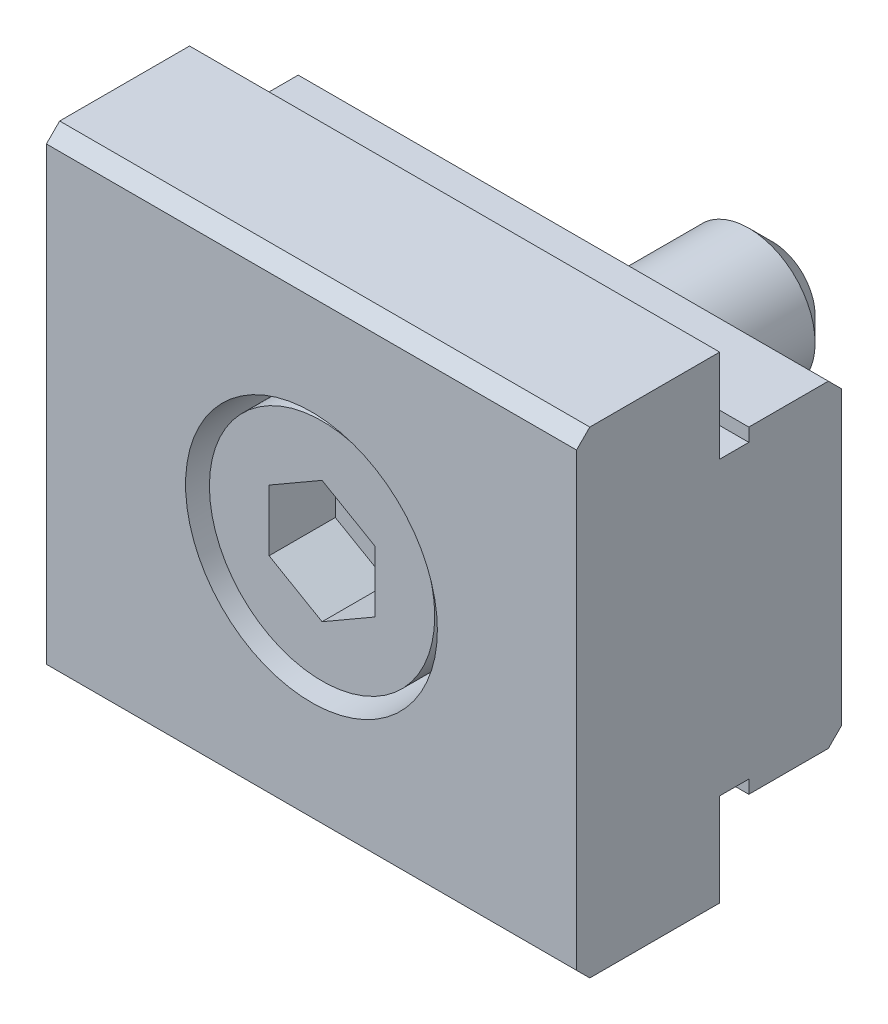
ISO-10303-21;
HEADER;
FILE_DESCRIPTION(('STEP AP214'),'2;1');
FILE_NAME('part.step','',(''),(''),'','','');
FILE_SCHEMA(('AUTOMOTIVE_DESIGN { 1 0 10303 214 1 1 1 1 }'));
ENDSEC;
DATA;
#1=APPLICATION_CONTEXT('core data for automotive mechanical design processes');
#2=APPLICATION_PROTOCOL_DEFINITION('international standard','automotive_design',2000,#1);
#3=PRODUCT_CONTEXT('',#1,'mechanical');
#4=PRODUCT('Part','Part','',(#3));
#5=PRODUCT_RELATED_PRODUCT_CATEGORY('part','',(#4));
#6=PRODUCT_DEFINITION_FORMATION('','',#4);
#7=PRODUCT_DEFINITION_CONTEXT('part definition',#1,'design');
#8=PRODUCT_DEFINITION('design','',#6,#7);
#9=PRODUCT_DEFINITION_SHAPE('','',#8);
#10=(LENGTH_UNIT() NAMED_UNIT(*) SI_UNIT(.MILLI.,.METRE.));
#11=(NAMED_UNIT(*) PLANE_ANGLE_UNIT() SI_UNIT($,.RADIAN.));
#12=(NAMED_UNIT(*) SI_UNIT($,.STERADIAN.) SOLID_ANGLE_UNIT());
#13=UNCERTAINTY_MEASURE_WITH_UNIT(LENGTH_MEASURE(1.E-05),#10,'distance_accuracy_value','');
#14=(GEOMETRIC_REPRESENTATION_CONTEXT(3) GLOBAL_UNCERTAINTY_ASSIGNED_CONTEXT((#13)) GLOBAL_UNIT_ASSIGNED_CONTEXT((#10,
#11,#12)) REPRESENTATION_CONTEXT('',''));
#15=CARTESIAN_POINT('',(0.,0.,0.));
#16=DIRECTION('',(0.,0.,1.));
#17=DIRECTION('',(1.,0.,0.));
#18=AXIS2_PLACEMENT_3D('',#15,#16,#17);
#19=CARTESIAN_POINT('',(-12.5,-6.,-1.1));
#20=DIRECTION('',(0.,0.,-1.));
#21=DIRECTION('',(-1.,0.,0.));
#22=AXIS2_PLACEMENT_3D('',#19,#20,#21);
#23=PLANE('',#22);
#24=DIRECTION('',(0.,1.,0.));
#25=VECTOR('',#24,1.);
#26=CARTESIAN_POINT('',(-10.,-6.,-1.1));
#27=LINE('',#26,#25);
#28=CARTESIAN_POINT('',(-10.,-6.,-1.1));
#29=VERTEX_POINT('',#28);
#30=CARTESIAN_POINT('',(-10.,-5.5,-1.1));
#31=VERTEX_POINT('',#30);
#32=EDGE_CURVE('E359',#29,#31,#27,.T.);
#33=ORIENTED_EDGE('',*,*,#32,.F.);
#34=DIRECTION('',(1.,0.,0.));
#35=VECTOR('',#34,1.);
#36=CARTESIAN_POINT('',(-12.5,-6.,-1.1));
#37=LINE('',#36,#35);
#38=CARTESIAN_POINT('',(10.,-6.,-1.1));
#39=VERTEX_POINT('',#38);
#40=EDGE_CURVE('E218',#29,#39,#37,.T.);
#41=ORIENTED_EDGE('',*,*,#40,.T.);
#42=DIRECTION('',(0.,-1.,0.));
#43=VECTOR('',#42,1.);
#44=CARTESIAN_POINT('',(10.,-6.,-1.1));
#45=LINE('',#44,#43);
#46=CARTESIAN_POINT('',(10.,-5.5,-1.1));
#47=VERTEX_POINT('',#46);
#48=EDGE_CURVE('E341',#47,#39,#45,.T.);
#49=ORIENTED_EDGE('',*,*,#48,.F.);
#50=DIRECTION('',(1.,0.,0.));
#51=VECTOR('',#50,1.);
#52=CARTESIAN_POINT('',(-12.5,-5.5,-1.1));
#53=LINE('',#52,#51);
#54=EDGE_CURVE('E215',#31,#47,#53,.T.);
#55=ORIENTED_EDGE('',*,*,#54,.F.);
#56=EDGE_LOOP('',(#33,#41,#49,#55));
#57=FACE_BOUND('',#56,.T.);
#58=ADVANCED_FACE('F14',(#57),#23,.F.);
#59=CARTESIAN_POINT('',(-12.5,-6.,-4.1));
#60=DIRECTION('',(0.,1.,0.));
#61=DIRECTION('',(1.,0.,0.));
#62=AXIS2_PLACEMENT_3D('',#59,#60,#61);
#63=PLANE('',#62);
#64=DIRECTION('',(0.,0.,1.));
#65=VECTOR('',#64,1.);
#66=CARTESIAN_POINT('',(-10.,-6.,-4.1));
#67=LINE('',#66,#65);
#68=CARTESIAN_POINT('',(-10.,-6.,-4.1));
#69=VERTEX_POINT('',#68);
#70=EDGE_CURVE('E357',#69,#29,#67,.T.);
#71=ORIENTED_EDGE('',*,*,#70,.F.);
#72=DIRECTION('',(1.,0.,0.));
#73=VECTOR('',#72,1.);
#74=CARTESIAN_POINT('',(-12.5,-6.,-4.1));
#75=LINE('',#74,#73);
#76=CARTESIAN_POINT('',(10.,-6.,-4.1));
#77=VERTEX_POINT('',#76);
#78=EDGE_CURVE('E221',#69,#77,#75,.T.);
#79=ORIENTED_EDGE('',*,*,#78,.T.);
#80=DIRECTION('',(0.,0.,-1.));
#81=VECTOR('',#80,1.);
#82=CARTESIAN_POINT('',(10.,-6.,-4.1));
#83=LINE('',#82,#81);
#84=EDGE_CURVE('E339',#39,#77,#83,.T.);
#85=ORIENTED_EDGE('',*,*,#84,.F.);
#86=ORIENTED_EDGE('',*,*,#40,.F.);
#87=EDGE_LOOP('',(#71,#79,#85,#86));
#88=FACE_BOUND('',#87,.T.);
#89=ADVANCED_FACE('F400',(#88),#63,.F.);
#90=CARTESIAN_POINT('',(-12.5,6.,-4.1));
#91=DIRECTION('',(0.,-1.,0.));
#92=DIRECTION('',(-1.,0.,0.));
#93=AXIS2_PLACEMENT_3D('',#90,#91,#92);
#94=PLANE('',#93);
#95=DIRECTION('',(0.,0.,-1.));
#96=VECTOR('',#95,1.);
#97=CARTESIAN_POINT('',(-10.,6.,-4.1));
#98=LINE('',#97,#96);
#99=CARTESIAN_POINT('',(-10.,6.,-1.1));
#100=VERTEX_POINT('',#99);
#101=CARTESIAN_POINT('',(-10.,6.,-4.1));
#102=VERTEX_POINT('',#101);
#103=EDGE_CURVE('E24',#100,#102,#98,.T.);
#104=ORIENTED_EDGE('',*,*,#103,.F.);
#105=DIRECTION('',(1.,0.,0.));
#106=VECTOR('',#105,1.);
#107=CARTESIAN_POINT('',(-12.5,6.,-1.1));
#108=LINE('',#107,#106);
#109=CARTESIAN_POINT('',(10.,6.,-1.1));
#110=VERTEX_POINT('',#109);
#111=EDGE_CURVE('E188',#100,#110,#108,.T.);
#112=ORIENTED_EDGE('',*,*,#111,.T.);
#113=DIRECTION('',(0.,0.,1.));
#114=VECTOR('',#113,1.);
#115=CARTESIAN_POINT('',(10.,6.,-4.1));
#116=LINE('',#115,#114);
#117=CARTESIAN_POINT('',(10.,6.,-4.1));
#118=VERTEX_POINT('',#117);
#119=EDGE_CURVE('E191',#118,#110,#116,.T.);
#120=ORIENTED_EDGE('',*,*,#119,.F.);
#121=DIRECTION('',(1.,0.,0.));
#122=VECTOR('',#121,1.);
#123=CARTESIAN_POINT('',(-12.5,6.,-4.1));
#124=LINE('',#123,#122);
#125=EDGE_CURVE('E190',#102,#118,#124,.T.);
#126=ORIENTED_EDGE('',*,*,#125,.F.);
#127=EDGE_LOOP('',(#104,#112,#120,#126));
#128=FACE_BOUND('',#127,.T.);
#129=ADVANCED_FACE('F186',(#128),#94,.F.);
#130=CARTESIAN_POINT('',(-12.5,6.,-1.1));
#131=DIRECTION('',(0.,0.,-1.));
#132=DIRECTION('',(-1.,0.,0.));
#133=AXIS2_PLACEMENT_3D('',#130,#131,#132);
#134=PLANE('',#133);
#135=DIRECTION('',(0.,1.,0.));
#136=VECTOR('',#135,1.);
#137=CARTESIAN_POINT('',(-10.,6.,-1.1));
#138=LINE('',#137,#136);
#139=CARTESIAN_POINT('',(-10.,5.5,-1.1));
#140=VERTEX_POINT('',#139);
#141=EDGE_CURVE('E171',#140,#100,#138,.T.);
#142=ORIENTED_EDGE('',*,*,#141,.F.);
#143=DIRECTION('',(1.,0.,0.));
#144=VECTOR('',#143,1.);
#145=CARTESIAN_POINT('',(-12.5,5.5,-1.1));
#146=LINE('',#145,#144);
#147=CARTESIAN_POINT('',(10.,5.5,-1.1));
#148=VERTEX_POINT('',#147);
#149=EDGE_CURVE('E196',#140,#148,#146,.T.);
#150=ORIENTED_EDGE('',*,*,#149,.T.);
#151=DIRECTION('',(0.,-1.,0.));
#152=VECTOR('',#151,1.);
#153=CARTESIAN_POINT('',(10.,6.,-1.1));
#154=LINE('',#153,#152);
#155=EDGE_CURVE('E195',#110,#148,#154,.T.);
#156=ORIENTED_EDGE('',*,*,#155,.F.);
#157=ORIENTED_EDGE('',*,*,#111,.F.);
#158=EDGE_LOOP('',(#142,#150,#156,#157));
#159=FACE_BOUND('',#158,.T.);
#160=ADVANCED_FACE('F194',(#159),#134,.F.);
#161=CARTESIAN_POINT('',(-12.5,5.5,-1.1));
#162=DIRECTION('',(0.,-1.,0.));
#163=DIRECTION('',(-1.,0.,0.));
#164=AXIS2_PLACEMENT_3D('',#161,#162,#163);
#165=PLANE('',#164);
#166=DIRECTION('',(0.,0.,-1.));
#167=VECTOR('',#166,1.);
#168=CARTESIAN_POINT('',(-10.,5.5,-1.1));
#169=LINE('',#168,#167);
#170=CARTESIAN_POINT('',(-10.,5.5,0.));
#171=VERTEX_POINT('',#170);
#172=EDGE_CURVE('E176',#171,#140,#169,.T.);
#173=ORIENTED_EDGE('',*,*,#172,.F.);
#174=DIRECTION('',(-1.,0.,0.));
#175=VECTOR('',#174,1.);
#176=CARTESIAN_POINT('',(10.,5.5,0.));
#177=LINE('',#176,#175);
#178=CARTESIAN_POINT('',(10.,5.5,0.));
#179=VERTEX_POINT('',#178);
#180=EDGE_CURVE('E310',#179,#171,#177,.T.);
#181=ORIENTED_EDGE('',*,*,#180,.F.);
#182=DIRECTION('',(0.,0.,1.));
#183=VECTOR('',#182,1.);
#184=CARTESIAN_POINT('',(10.,5.5,-1.1));
#185=LINE('',#184,#183);
#186=EDGE_CURVE('E331',#148,#179,#185,.T.);
#187=ORIENTED_EDGE('',*,*,#186,.F.);
#188=ORIENTED_EDGE('',*,*,#149,.F.);
#189=EDGE_LOOP('',(#173,#181,#187,#188));
#190=FACE_BOUND('',#189,.T.);
#191=ADVANCED_FACE('F671',(#190),#165,.F.);
#192=CARTESIAN_POINT('',(-10.,5.5,0.));
#193=DIRECTION('',(0.,0.,-1.));
#194=DIRECTION('',(-1.,0.,0.));
#195=AXIS2_PLACEMENT_3D('',#192,#193,#194);
#196=PLANE('',#195);
#197=ORIENTED_EDGE('',*,*,#180,.T.);
#198=DIRECTION('',(0.,1.,0.));
#199=VECTOR('',#198,1.);
#200=CARTESIAN_POINT('',(-10.,5.5,0.));
#201=LINE('',#200,#199);
#202=CARTESIAN_POINT('',(-10.,9.,0.));
#203=VERTEX_POINT('',#202);
#204=EDGE_CURVE('E313',#171,#203,#201,.T.);
#205=ORIENTED_EDGE('',*,*,#204,.T.);
#206=DIRECTION('',(1.,0.,0.));
#207=VECTOR('',#206,1.);
#208=CARTESIAN_POINT('',(-10.,9.,0.));
#209=LINE('',#208,#207);
#210=CARTESIAN_POINT('',(10.,9.,0.));
#211=VERTEX_POINT('',#210);
#212=EDGE_CURVE('E315',#203,#211,#209,.T.);
#213=ORIENTED_EDGE('',*,*,#212,.T.);
#214=DIRECTION('',(0.,-1.,0.));
#215=VECTOR('',#214,1.);
#216=CARTESIAN_POINT('',(10.,9.,0.));
#217=LINE('',#216,#215);
#218=EDGE_CURVE('E317',#211,#179,#217,.T.);
#219=ORIENTED_EDGE('',*,*,#218,.T.);
#220=EDGE_LOOP('',(#197,#205,#213,#219));
#221=FACE_BOUND('',#220,.T.);
#222=ADVANCED_FACE('F661',(#221),#196,.T.);
#223=CARTESIAN_POINT('',(-12.5,9.,-0.1));
#224=DIRECTION('',(0.,-1.,0.));
#225=DIRECTION('',(-1.,0.,0.));
#226=AXIS2_PLACEMENT_3D('',#223,#224,#225);
#227=PLANE('',#226);
#228=ORIENTED_EDGE('',*,*,#212,.F.);
#229=DIRECTION('',(0.,0.,1.));
#230=VECTOR('',#229,1.);
#231=CARTESIAN_POINT('',(-10.,9.,-14.6));
#232=LINE('',#231,#230);
#233=CARTESIAN_POINT('',(-10.,9.,4.9));
#234=VERTEX_POINT('',#233);
#235=EDGE_CURVE('E320',#203,#234,#232,.T.);
#236=ORIENTED_EDGE('',*,*,#235,.T.);
#237=DIRECTION('',(1.,0.,0.));
#238=VECTOR('',#237,1.);
#239=CARTESIAN_POINT('',(-12.5,9.,4.9));
#240=LINE('',#239,#238);
#241=CARTESIAN_POINT('',(10.,9.,4.9));
#242=VERTEX_POINT('',#241);
#243=EDGE_CURVE('E198',#234,#242,#240,.T.);
#244=ORIENTED_EDGE('',*,*,#243,.T.);
#245=DIRECTION('',(0.,0.,-1.));
#246=VECTOR('',#245,1.);
#247=CARTESIAN_POINT('',(10.,9.,-14.6));
#248=LINE('',#247,#246);
#249=EDGE_CURVE('E322',#242,#211,#248,.T.);
#250=ORIENTED_EDGE('',*,*,#249,.T.);
#251=EDGE_LOOP('',(#228,#236,#244,#250));
#252=FACE_BOUND('',#251,.T.);
#253=ADVANCED_FACE('F651',(#252),#227,.F.);
#254=CARTESIAN_POINT('',(-12.5,9.,4.9));
#255=DIRECTION('',(0.,-0.707106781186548,-0.707106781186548));
#256=DIRECTION('',(0.,-0.707106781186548,0.707106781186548));
#257=AXIS2_PLACEMENT_3D('',#254,#255,#256);
#258=PLANE('',#257);
#259=DIRECTION('',(0.,0.707106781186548,-0.707106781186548));
#260=VECTOR('',#259,1.);
#261=CARTESIAN_POINT('',(-10.,9.,4.9));
#262=LINE('',#261,#260);
#263=CARTESIAN_POINT('',(-10.,8.5,5.4));
#264=VERTEX_POINT('',#263);
#265=EDGE_CURVE('E362',#264,#234,#262,.T.);
#266=ORIENTED_EDGE('',*,*,#265,.F.);
#267=DIRECTION('',(1.,0.,0.));
#268=VECTOR('',#267,1.);
#269=CARTESIAN_POINT('',(-12.5,8.5,5.4));
#270=LINE('',#269,#268);
#271=CARTESIAN_POINT('',(10.,8.5,5.4));
#272=VERTEX_POINT('',#271);
#273=EDGE_CURVE('E206',#264,#272,#270,.T.);
#274=ORIENTED_EDGE('',*,*,#273,.T.);
#275=DIRECTION('',(0.,-0.707106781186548,0.707106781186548));
#276=VECTOR('',#275,1.);
#277=CARTESIAN_POINT('',(10.,9.,4.9));
#278=LINE('',#277,#276);
#279=EDGE_CURVE('E345',#242,#272,#278,.T.);
#280=ORIENTED_EDGE('',*,*,#279,.F.);
#281=ORIENTED_EDGE('',*,*,#243,.F.);
#282=EDGE_LOOP('',(#266,#274,#280,#281));
#283=FACE_BOUND('',#282,.T.);
#284=ADVANCED_FACE('F641',(#283),#258,.F.);
#285=CARTESIAN_POINT('',(-12.5,8.5,5.4));
#286=DIRECTION('',(0.,0.,-1.));
#287=DIRECTION('',(-1.,0.,0.));
#288=AXIS2_PLACEMENT_3D('',#285,#286,#287);
#289=PLANE('',#288);
#290=CARTESIAN_POINT('',(0.,0.,5.4));
#291=DIRECTION('',(0.,0.,1.));
#292=DIRECTION('',(1.,0.,0.));
#293=AXIS2_PLACEMENT_3D('',#290,#291,#292);
#294=CIRCLE('',#293,4.75);
#295=CARTESIAN_POINT('',(4.75,0.,5.4));
#296=VERTEX_POINT('',#295);
#297=EDGE_CURVE('E299',#296,#296,#294,.T.);
#298=ORIENTED_EDGE('',*,*,#297,.F.);
#299=EDGE_LOOP('',(#298));
#300=FACE_BOUND('',#299,.T.);
#301=DIRECTION('',(0.,1.,0.));
#302=VECTOR('',#301,1.);
#303=CARTESIAN_POINT('',(-10.,8.5,5.4));
#304=LINE('',#303,#302);
#305=CARTESIAN_POINT('',(-10.,-8.5,5.4));
#306=VERTEX_POINT('',#305);
#307=EDGE_CURVE('E365',#306,#264,#304,.T.);
#308=ORIENTED_EDGE('',*,*,#307,.F.);
#309=DIRECTION('',(1.,0.,0.));
#310=VECTOR('',#309,1.);
#311=CARTESIAN_POINT('',(-12.5,-8.5,5.4));
#312=LINE('',#311,#310);
#313=CARTESIAN_POINT('',(10.,-8.5,5.4));
#314=VERTEX_POINT('',#313);
#315=EDGE_CURVE('E209',#306,#314,#312,.T.);
#316=ORIENTED_EDGE('',*,*,#315,.T.);
#317=DIRECTION('',(0.,-1.,0.));
#318=VECTOR('',#317,1.);
#319=CARTESIAN_POINT('',(10.,8.5,5.4));
#320=LINE('',#319,#318);
#321=EDGE_CURVE('E347',#272,#314,#320,.T.);
#322=ORIENTED_EDGE('',*,*,#321,.F.);
#323=ORIENTED_EDGE('',*,*,#273,.F.);
#324=EDGE_LOOP('',(#308,#316,#322,#323));
#325=FACE_BOUND('',#324,.T.);
#326=ADVANCED_FACE('F375',(#300,#325),#289,.F.);
#327=CARTESIAN_POINT('',(0.,0.,5.4));
#328=DIRECTION('',(0.,0.,1.));
#329=DIRECTION('',(1.,0.,0.));
#330=AXIS2_PLACEMENT_3D('',#327,#328,#329);
#331=CYLINDRICAL_SURFACE('',#330,4.75);
#332=CARTESIAN_POINT('',(0.,0.,0.));
#333=DIRECTION('',(0.,0.,1.));
#334=DIRECTION('',(1.,0.,0.));
#335=AXIS2_PLACEMENT_3D('',#332,#333,#334);
#336=CIRCLE('',#335,4.75);
#337=CARTESIAN_POINT('',(4.75,0.,0.));
#338=VERTEX_POINT('',#337);
#339=EDGE_CURVE('E294',#338,#338,#336,.T.);
#340=ORIENTED_EDGE('',*,*,#339,.F.);
#341=EDGE_LOOP('',(#340));
#342=FACE_BOUND('',#341,.T.);
#343=ORIENTED_EDGE('',*,*,#297,.T.);
#344=EDGE_LOOP('',(#343));
#345=FACE_BOUND('',#344,.T.);
#346=ADVANCED_FACE('F622',(#342,#345),#331,.F.);
#347=CARTESIAN_POINT('',(-2.75,0.,0.));
#348=DIRECTION('',(0.,0.,-1.));
#349=DIRECTION('',(-1.,0.,0.));
#350=AXIS2_PLACEMENT_3D('',#347,#348,#349);
#351=PLANE('',#350);
#352=CARTESIAN_POINT('',(0.,0.,0.));
#353=DIRECTION('',(0.,0.,-1.));
#354=DIRECTION('',(-1.,0.,0.));
#355=AXIS2_PLACEMENT_3D('',#352,#353,#354);
#356=CIRCLE('',#355,4.25);
#357=CARTESIAN_POINT('',(-4.25,0.,0.));
#358=VERTEX_POINT('',#357);
#359=EDGE_CURVE('E9',#358,#358,#356,.T.);
#360=ORIENTED_EDGE('',*,*,#359,.T.);
#361=EDGE_LOOP('',(#360));
#362=FACE_BOUND('',#361,.T.);
#363=ORIENTED_EDGE('',*,*,#339,.T.);
#364=EDGE_LOOP('',(#363));
#365=FACE_BOUND('',#364,.T.);
#366=ADVANCED_FACE('F396',(#362,#365),#351,.F.);
#367=CARTESIAN_POINT('',(-12.5,-9.,4.9));
#368=DIRECTION('',(0.,0.707106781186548,-0.707106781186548));
#369=DIRECTION('',(0.,-0.707106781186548,-0.707106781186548));
#370=AXIS2_PLACEMENT_3D('',#367,#368,#369);
#371=PLANE('',#370);
#372=DIRECTION('',(0.,0.707106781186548,0.707106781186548));
#373=VECTOR('',#372,1.);
#374=CARTESIAN_POINT('',(-10.,-9.,4.9));
#375=LINE('',#374,#373);
#376=CARTESIAN_POINT('',(-10.,-9.,4.9));
#377=VERTEX_POINT('',#376);
#378=EDGE_CURVE('E200',#377,#306,#375,.T.);
#379=ORIENTED_EDGE('',*,*,#378,.F.);
#380=DIRECTION('',(1.,0.,0.));
#381=VECTOR('',#380,1.);
#382=CARTESIAN_POINT('',(-12.5,-9.,4.9));
#383=LINE('',#382,#381);
#384=CARTESIAN_POINT('',(10.,-9.,4.9));
#385=VERTEX_POINT('',#384);
#386=EDGE_CURVE('E212',#377,#385,#383,.T.);
#387=ORIENTED_EDGE('',*,*,#386,.T.);
#388=DIRECTION('',(0.,-0.707106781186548,-0.707106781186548));
#389=VECTOR('',#388,1.);
#390=CARTESIAN_POINT('',(10.,-9.,4.9));
#391=LINE('',#390,#389);
#392=EDGE_CURVE('E181',#314,#385,#391,.T.);
#393=ORIENTED_EDGE('',*,*,#392,.F.);
#394=ORIENTED_EDGE('',*,*,#315,.F.);
#395=EDGE_LOOP('',(#379,#387,#393,#394));
#396=FACE_BOUND('',#395,.T.);
#397=ADVANCED_FACE('F378',(#396),#371,.F.);
#398=CARTESIAN_POINT('',(-12.5,-9.,-0.1));
#399=DIRECTION('',(0.,1.,0.));
#400=DIRECTION('',(1.,0.,0.));
#401=AXIS2_PLACEMENT_3D('',#398,#399,#400);
#402=PLANE('',#401);
#403=DIRECTION('',(-1.,0.,0.));
#404=VECTOR('',#403,1.);
#405=CARTESIAN_POINT('',(10.,-9.,0.));
#406=LINE('',#405,#404);
#407=CARTESIAN_POINT('',(10.,-9.,0.));
#408=VERTEX_POINT('',#407);
#409=CARTESIAN_POINT('',(-10.,-9.,0.));
#410=VERTEX_POINT('',#409);
#411=EDGE_CURVE('E33',#408,#410,#406,.T.);
#412=ORIENTED_EDGE('',*,*,#411,.F.);
#413=DIRECTION('',(0.,0.,-1.));
#414=VECTOR('',#413,1.);
#415=CARTESIAN_POINT('',(10.,-9.,-14.6));
#416=LINE('',#415,#414);
#417=EDGE_CURVE('E327',#385,#408,#416,.T.);
#418=ORIENTED_EDGE('',*,*,#417,.F.);
#419=ORIENTED_EDGE('',*,*,#386,.F.);
#420=DIRECTION('',(0.,0.,1.));
#421=VECTOR('',#420,1.);
#422=CARTESIAN_POINT('',(-10.,-9.,-14.6));
#423=LINE('',#422,#421);
#424=EDGE_CURVE('E325',#410,#377,#423,.T.);
#425=ORIENTED_EDGE('',*,*,#424,.F.);
#426=EDGE_LOOP('',(#412,#418,#419,#425));
#427=FACE_BOUND('',#426,.T.);
#428=ADVANCED_FACE('F384',(#427),#402,.F.);
#429=CARTESIAN_POINT('',(-10.,-9.,0.));
#430=DIRECTION('',(0.,0.,-1.));
#431=DIRECTION('',(-1.,0.,0.));
#432=AXIS2_PLACEMENT_3D('',#429,#430,#431);
#433=PLANE('',#432);
#434=ORIENTED_EDGE('',*,*,#411,.T.);
#435=DIRECTION('',(0.,1.,0.));
#436=VECTOR('',#435,1.);
#437=CARTESIAN_POINT('',(-10.,-9.,0.));
#438=LINE('',#437,#436);
#439=CARTESIAN_POINT('',(-10.,-5.5,0.));
#440=VERTEX_POINT('',#439);
#441=EDGE_CURVE('E303',#410,#440,#438,.T.);
#442=ORIENTED_EDGE('',*,*,#441,.T.);
#443=DIRECTION('',(1.,0.,0.));
#444=VECTOR('',#443,1.);
#445=CARTESIAN_POINT('',(-10.,-5.5,0.));
#446=LINE('',#445,#444);
#447=CARTESIAN_POINT('',(10.,-5.5,0.));
#448=VERTEX_POINT('',#447);
#449=EDGE_CURVE('E305',#440,#448,#446,.T.);
#450=ORIENTED_EDGE('',*,*,#449,.T.);
#451=DIRECTION('',(0.,-1.,0.));
#452=VECTOR('',#451,1.);
#453=CARTESIAN_POINT('',(10.,-5.5,0.));
#454=LINE('',#453,#452);
#455=EDGE_CURVE('E308',#448,#408,#454,.T.);
#456=ORIENTED_EDGE('',*,*,#455,.T.);
#457=EDGE_LOOP('',(#434,#442,#450,#456));
#458=FACE_BOUND('',#457,.T.);
#459=ADVANCED_FACE('F386',(#458),#433,.T.);
#460=CARTESIAN_POINT('',(-12.5,-5.5,-1.1));
#461=DIRECTION('',(0.,1.,0.));
#462=DIRECTION('',(1.,0.,0.));
#463=AXIS2_PLACEMENT_3D('',#460,#461,#462);
#464=PLANE('',#463);
#465=DIRECTION('',(0.,0.,1.));
#466=VECTOR('',#465,1.);
#467=CARTESIAN_POINT('',(-10.,-5.5,-1.1));
#468=LINE('',#467,#466);
#469=EDGE_CURVE('E86',#31,#440,#468,.T.);
#470=ORIENTED_EDGE('',*,*,#469,.F.);
#471=ORIENTED_EDGE('',*,*,#54,.T.);
#472=DIRECTION('',(0.,0.,-1.));
#473=VECTOR('',#472,1.);
#474=CARTESIAN_POINT('',(10.,-5.5,-1.1));
#475=LINE('',#474,#473);
#476=EDGE_CURVE('E343',#448,#47,#475,.T.);
#477=ORIENTED_EDGE('',*,*,#476,.F.);
#478=ORIENTED_EDGE('',*,*,#449,.F.);
#479=EDGE_LOOP('',(#470,#471,#477,#478));
#480=FACE_BOUND('',#479,.T.);
#481=ADVANCED_FACE('F394',(#480),#464,.F.);
#482=CARTESIAN_POINT('',(-12.5,-5.5,-4.6));
#483=DIRECTION('',(0.,0.707106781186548,0.707106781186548));
#484=DIRECTION('',(0.,0.707106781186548,-0.707106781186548));
#485=AXIS2_PLACEMENT_3D('',#482,#483,#484);
#486=PLANE('',#485);
#487=DIRECTION('',(0.,-0.707106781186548,0.707106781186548));
#488=VECTOR('',#487,1.);
#489=CARTESIAN_POINT('',(-10.,-5.5,-4.6));
#490=LINE('',#489,#488);
#491=CARTESIAN_POINT('',(-10.,-5.5,-4.6));
#492=VERTEX_POINT('',#491);
#493=EDGE_CURVE('E355',#492,#69,#490,.T.);
#494=ORIENTED_EDGE('',*,*,#493,.F.);
#495=DIRECTION('',(1.,0.,0.));
#496=VECTOR('',#495,1.);
#497=CARTESIAN_POINT('',(-12.5,-5.5,-4.6));
#498=LINE('',#497,#496);
#499=CARTESIAN_POINT('',(10.,-5.5,-4.6));
#500=VERTEX_POINT('',#499);
#501=EDGE_CURVE('E224',#492,#500,#498,.T.);
#502=ORIENTED_EDGE('',*,*,#501,.T.);
#503=DIRECTION('',(0.,0.707106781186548,-0.707106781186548));
#504=VECTOR('',#503,1.);
#505=CARTESIAN_POINT('',(10.,-5.5,-4.6));
#506=LINE('',#505,#504);
#507=EDGE_CURVE('E337',#77,#500,#506,.T.);
#508=ORIENTED_EDGE('',*,*,#507,.F.);
#509=ORIENTED_EDGE('',*,*,#78,.F.);
#510=EDGE_LOOP('',(#494,#502,#508,#509));
#511=FACE_BOUND('',#510,.T.);
#512=ADVANCED_FACE('F411',(#511),#486,.F.);
#513=CARTESIAN_POINT('',(10.,-9.,-14.6));
#514=DIRECTION('',(1.,0.,0.));
#515=DIRECTION('',(0.,-1.,0.));
#516=AXIS2_PLACEMENT_3D('',#513,#514,#515);
#517=PLANE('',#516);
#518=ORIENTED_EDGE('',*,*,#455,.F.);
#519=ORIENTED_EDGE('',*,*,#476,.T.);
#520=ORIENTED_EDGE('',*,*,#48,.T.);
#521=ORIENTED_EDGE('',*,*,#84,.T.);
#522=ORIENTED_EDGE('',*,*,#507,.T.);
#523=DIRECTION('',(0.,1.,0.));
#524=VECTOR('',#523,1.);
#525=CARTESIAN_POINT('',(10.,5.5,-4.6));
#526=LINE('',#525,#524);
#527=CARTESIAN_POINT('',(10.,5.5,-4.6));
#528=VERTEX_POINT('',#527);
#529=EDGE_CURVE('E335',#500,#528,#526,.T.);
#530=ORIENTED_EDGE('',*,*,#529,.T.);
#531=DIRECTION('',(0.,0.707106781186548,0.707106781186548));
#532=VECTOR('',#531,1.);
#533=CARTESIAN_POINT('',(10.,5.5,-4.6));
#534=LINE('',#533,#532);
#535=EDGE_CURVE('E333',#528,#118,#534,.T.);
#536=ORIENTED_EDGE('',*,*,#535,.T.);
#537=ORIENTED_EDGE('',*,*,#119,.T.);
#538=ORIENTED_EDGE('',*,*,#155,.T.);
#539=ORIENTED_EDGE('',*,*,#186,.T.);
#540=ORIENTED_EDGE('',*,*,#218,.F.);
#541=ORIENTED_EDGE('',*,*,#249,.F.);
#542=ORIENTED_EDGE('',*,*,#279,.T.);
#543=ORIENTED_EDGE('',*,*,#321,.T.);
#544=ORIENTED_EDGE('',*,*,#392,.T.);
#545=ORIENTED_EDGE('',*,*,#417,.T.);
#546=EDGE_LOOP('',(#518,#519,#520,#521,#522,#530,#536,#537,#538,#539,#540,#541,#542,#543,#544,#545));
#547=FACE_BOUND('',#546,.T.);
#548=ADVANCED_FACE('F382',(#547),#517,.T.);
#549=CARTESIAN_POINT('',(-12.5,5.5,-4.6));
#550=DIRECTION('',(0.,-0.707106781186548,0.707106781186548));
#551=DIRECTION('',(0.,0.707106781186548,0.707106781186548));
#552=AXIS2_PLACEMENT_3D('',#549,#550,#551);
#553=PLANE('',#552);
#554=DIRECTION('',(0.,-0.707106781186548,-0.707106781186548));
#555=VECTOR('',#554,1.);
#556=CARTESIAN_POINT('',(-10.,5.5,-4.6));
#557=LINE('',#556,#555);
#558=CARTESIAN_POINT('',(-10.,5.5,-4.6));
#559=VERTEX_POINT('',#558);
#560=EDGE_CURVE('E351',#102,#559,#557,.T.);
#561=ORIENTED_EDGE('',*,*,#560,.F.);
#562=ORIENTED_EDGE('',*,*,#125,.T.);
#563=ORIENTED_EDGE('',*,*,#535,.F.);
#564=DIRECTION('',(1.,0.,0.));
#565=VECTOR('',#564,1.);
#566=CARTESIAN_POINT('',(-12.5,5.5,-4.6));
#567=LINE('',#566,#565);
#568=EDGE_CURVE('E227',#559,#528,#567,.T.);
#569=ORIENTED_EDGE('',*,*,#568,.F.);
#570=EDGE_LOOP('',(#561,#562,#563,#569));
#571=FACE_BOUND('',#570,.T.);
#572=ADVANCED_FACE('F419',(#571),#553,.F.);
#573=CARTESIAN_POINT('',(-10.,-9.,-14.6));
#574=DIRECTION('',(-1.,0.,0.));
#575=DIRECTION('',(0.,1.,0.));
#576=AXIS2_PLACEMENT_3D('',#573,#574,#575);
#577=PLANE('',#576);
#578=ORIENTED_EDGE('',*,*,#469,.T.);
#579=ORIENTED_EDGE('',*,*,#441,.F.);
#580=ORIENTED_EDGE('',*,*,#424,.T.);
#581=ORIENTED_EDGE('',*,*,#378,.T.);
#582=ORIENTED_EDGE('',*,*,#307,.T.);
#583=ORIENTED_EDGE('',*,*,#265,.T.);
#584=ORIENTED_EDGE('',*,*,#235,.F.);
#585=ORIENTED_EDGE('',*,*,#204,.F.);
#586=ORIENTED_EDGE('',*,*,#172,.T.);
#587=ORIENTED_EDGE('',*,*,#141,.T.);
#588=ORIENTED_EDGE('',*,*,#103,.T.);
#589=ORIENTED_EDGE('',*,*,#560,.T.);
#590=DIRECTION('',(0.,-1.,0.));
#591=VECTOR('',#590,1.);
#592=CARTESIAN_POINT('',(-10.,5.5,-4.6));
#593=LINE('',#592,#591);
#594=EDGE_CURVE('E353',#559,#492,#593,.T.);
#595=ORIENTED_EDGE('',*,*,#594,.T.);
#596=ORIENTED_EDGE('',*,*,#493,.T.);
#597=ORIENTED_EDGE('',*,*,#70,.T.);
#598=ORIENTED_EDGE('',*,*,#32,.T.);
#599=EDGE_LOOP('',(#578,#579,#580,#581,#582,#583,#584,#585,#586,#587,#588,#589,#595,#596,#597,#598));
#600=FACE_BOUND('',#599,.T.);
#601=ADVANCED_FACE('F173',(#600),#577,.T.);
#602=CARTESIAN_POINT('',(-12.5,5.5,-4.6));
#603=DIRECTION('',(0.,0.,1.));
#604=DIRECTION('',(1.,0.,0.));
#605=AXIS2_PLACEMENT_3D('',#602,#603,#604);
#606=PLANE('',#605);
#607=CARTESIAN_POINT('',(0.,0.,-4.6));
#608=DIRECTION('',(0.,0.,1.));
#609=DIRECTION('',(1.,0.,0.));
#610=AXIS2_PLACEMENT_3D('',#607,#608,#609);
#611=CIRCLE('',#610,2.75);
#612=CARTESIAN_POINT('',(2.75,0.,-4.6));
#613=VERTEX_POINT('',#612);
#614=EDGE_CURVE('E285',#613,#613,#611,.T.);
#615=ORIENTED_EDGE('',*,*,#614,.T.);
#616=EDGE_LOOP('',(#615));
#617=FACE_BOUND('',#616,.T.);
#618=ORIENTED_EDGE('',*,*,#594,.F.);
#619=ORIENTED_EDGE('',*,*,#568,.T.);
#620=ORIENTED_EDGE('',*,*,#529,.F.);
#621=ORIENTED_EDGE('',*,*,#501,.F.);
#622=EDGE_LOOP('',(#618,#619,#620,#621));
#623=FACE_BOUND('',#622,.T.);
#624=ADVANCED_FACE('F415',(#617,#623),#606,.F.);
#625=CARTESIAN_POINT('',(0.,0.,5.4));
#626=DIRECTION('',(0.,0.,1.));
#627=DIRECTION('',(1.,0.,0.));
#628=AXIS2_PLACEMENT_3D('',#625,#626,#627);
#629=CYLINDRICAL_SURFACE('',#628,2.75);
#630=ORIENTED_EDGE('',*,*,#614,.F.);
#631=EDGE_LOOP('',(#630));
#632=FACE_BOUND('',#631,.T.);
#633=CARTESIAN_POINT('',(0.,0.,0.));
#634=DIRECTION('',(0.,0.,1.));
#635=DIRECTION('',(1.,0.,0.));
#636=AXIS2_PLACEMENT_3D('',#633,#634,#635);
#637=CIRCLE('',#636,2.75);
#638=CARTESIAN_POINT('',(2.75,0.,0.));
#639=VERTEX_POINT('',#638);
#640=EDGE_CURVE('E289',#639,#639,#637,.T.);
#641=ORIENTED_EDGE('',*,*,#640,.T.);
#642=EDGE_LOOP('',(#641));
#643=FACE_BOUND('',#642,.T.);
#644=ADVANCED_FACE('F418',(#632,#643),#629,.F.);
#645=CARTESIAN_POINT('',(2.5,0.,-12.));
#646=DIRECTION('',(0.,0.,-1.));
#647=DIRECTION('',(-1.,0.,0.));
#648=AXIS2_PLACEMENT_3D('',#645,#646,#647);
#649=PLANE('',#648);
#650=CARTESIAN_POINT('',(0.,0.,-12.));
#651=DIRECTION('',(0.,0.,-1.));
#652=DIRECTION('',(-1.,0.,0.));
#653=AXIS2_PLACEMENT_3D('',#650,#651,#652);
#654=CIRCLE('',#653,1.6);
#655=CARTESIAN_POINT('',(-1.6,0.,-12.));
#656=VERTEX_POINT('',#655);
#657=EDGE_CURVE('E18',#656,#656,#654,.T.);
#658=ORIENTED_EDGE('',*,*,#657,.T.);
#659=EDGE_LOOP('',(#658));
#660=FACE_BOUND('',#659,.T.);
#661=ADVANCED_FACE('F452',(#660),#649,.T.);
#662=CARTESIAN_POINT('',(0.,0.,-11.1));
#663=DIRECTION('',(0.,0.,1.));
#664=DIRECTION('',(1.,0.,0.));
#665=AXIS2_PLACEMENT_3D('',#662,#663,#664);
#666=CONICAL_SURFACE('',#665,2.5,0.785398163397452);
#667=ORIENTED_EDGE('',*,*,#657,.F.);
#668=EDGE_LOOP('',(#667));
#669=FACE_BOUND('',#668,.T.);
#670=CARTESIAN_POINT('',(0.,0.,-11.1));
#671=DIRECTION('',(0.,0.,-1.));
#672=DIRECTION('',(-1.,0.,0.));
#673=AXIS2_PLACEMENT_3D('',#670,#671,#672);
#674=CIRCLE('',#673,2.5);
#675=CARTESIAN_POINT('',(-2.5,0.,-11.1));
#676=VERTEX_POINT('',#675);
#677=EDGE_CURVE('E280',#676,#676,#674,.F.);
#678=ORIENTED_EDGE('',*,*,#677,.F.);
#679=EDGE_LOOP('',(#678));
#680=FACE_BOUND('',#679,.T.);
#681=ADVANCED_FACE('F16',(#669,#680),#666,.T.);
#682=CARTESIAN_POINT('',(0.,0.,8.));
#683=DIRECTION('',(0.,0.,1.));
#684=DIRECTION('',(1.,0.,0.));
#685=AXIS2_PLACEMENT_3D('',#682,#683,#684);
#686=CYLINDRICAL_SURFACE('',#685,2.5);
#687=ORIENTED_EDGE('',*,*,#677,.T.);
#688=EDGE_LOOP('',(#687));
#689=FACE_BOUND('',#688,.T.);
#690=CARTESIAN_POINT('',(0.,0.,0.));
#691=DIRECTION('',(0.,0.,1.));
#692=DIRECTION('',(1.,0.,0.));
#693=AXIS2_PLACEMENT_3D('',#690,#691,#692);
#694=CIRCLE('',#693,2.5);
#695=CARTESIAN_POINT('',(2.5,0.,0.));
#696=VERTEX_POINT('',#695);
#697=EDGE_CURVE('E275',#696,#696,#694,.T.);
#698=ORIENTED_EDGE('',*,*,#697,.F.);
#699=EDGE_LOOP('',(#698));
#700=FACE_BOUND('',#699,.T.);
#701=ADVANCED_FACE('F455',(#689,#700),#686,.T.);
#702=CARTESIAN_POINT('',(4.25,0.,0.));
#703=DIRECTION('',(0.,0.,-1.));
#704=DIRECTION('',(-1.,0.,0.));
#705=AXIS2_PLACEMENT_3D('',#702,#703,#704);
#706=PLANE('',#705);
#707=ORIENTED_EDGE('',*,*,#697,.T.);
#708=EDGE_LOOP('',(#707));
#709=FACE_BOUND('',#708,.T.);
#710=ORIENTED_EDGE('',*,*,#640,.F.);
#711=EDGE_LOOP('',(#710));
#712=FACE_BOUND('',#711,.T.);
#713=ADVANCED_FACE('F427',(#709,#712),#706,.T.);
#714=CARTESIAN_POINT('',(-2.,3.46410161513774,2.5));
#715=DIRECTION('',(0.,0.,-1.));
#716=DIRECTION('',(-1.,0.,0.));
#717=AXIS2_PLACEMENT_3D('',#714,#715,#716);
#718=PLANE('',#717);
#719=DIRECTION('',(0.86602540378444,-0.5,0.));
#720=VECTOR('',#719,1.);
#721=CARTESIAN_POINT('',(0.,2.3094010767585,2.5));
#722=LINE('',#721,#720);
#723=CARTESIAN_POINT('',(0.,2.3094010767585,2.5));
#724=VERTEX_POINT('',#723);
#725=CARTESIAN_POINT('',(2.,1.15470053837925,2.5));
#726=VERTEX_POINT('',#725);
#727=EDGE_CURVE('E234',#724,#726,#722,.T.);
#728=ORIENTED_EDGE('',*,*,#727,.F.);
#729=DIRECTION('',(-0.86602540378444,-0.5,0.));
#730=VECTOR('',#729,1.);
#731=CARTESIAN_POINT('',(0.,2.3094010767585,2.5));
#732=LINE('',#731,#730);
#733=CARTESIAN_POINT('',(-2.,1.15470053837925,2.5));
#734=VERTEX_POINT('',#733);
#735=EDGE_CURVE('E248',#724,#734,#732,.T.);
#736=ORIENTED_EDGE('',*,*,#735,.T.);
#737=DIRECTION('',(0.,-1.,0.));
#738=VECTOR('',#737,1.);
#739=CARTESIAN_POINT('',(-2.,1.15470053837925,2.5));
#740=LINE('',#739,#738);
#741=CARTESIAN_POINT('',(-2.,-1.15470053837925,2.5));
#742=VERTEX_POINT('',#741);
#743=EDGE_CURVE('E251',#734,#742,#740,.T.);
#744=ORIENTED_EDGE('',*,*,#743,.T.);
#745=DIRECTION('',(-0.86602540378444,0.5,0.));
#746=VECTOR('',#745,1.);
#747=CARTESIAN_POINT('',(0.,-2.3094010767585,2.5));
#748=LINE('',#747,#746);
#749=CARTESIAN_POINT('',(0.,-2.3094010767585,2.5));
#750=VERTEX_POINT('',#749);
#751=EDGE_CURVE('E254',#750,#742,#748,.T.);
#752=ORIENTED_EDGE('',*,*,#751,.F.);
#753=DIRECTION('',(0.86602540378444,0.5,0.));
#754=VECTOR('',#753,1.);
#755=CARTESIAN_POINT('',(0.,-2.3094010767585,2.5));
#756=LINE('',#755,#754);
#757=CARTESIAN_POINT('',(2.,-1.15470053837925,2.5));
#758=VERTEX_POINT('',#757);
#759=EDGE_CURVE('E257',#750,#758,#756,.T.);
#760=ORIENTED_EDGE('',*,*,#759,.T.);
#761=DIRECTION('',(0.,1.,0.));
#762=VECTOR('',#761,1.);
#763=CARTESIAN_POINT('',(2.,-1.15470053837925,2.5));
#764=LINE('',#763,#762);
#765=EDGE_CURVE('E260',#758,#726,#764,.T.);
#766=ORIENTED_EDGE('',*,*,#765,.T.);
#767=EDGE_LOOP('',(#728,#736,#744,#752,#760,#766));
#768=FACE_BOUND('',#767,.T.);
#769=ADVANCED_FACE('F423',(#768),#718,.F.);
#770=CARTESIAN_POINT('',(-2.,1.15470053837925,2.5));
#771=DIRECTION('',(-1.,0.,0.));
#772=DIRECTION('',(0.,-1.,0.));
#773=AXIS2_PLACEMENT_3D('',#770,#771,#772);
#774=PLANE('',#773);
#775=DIRECTION('',(0.,0.,1.));
#776=VECTOR('',#775,1.);
#777=CARTESIAN_POINT('',(-2.,1.15470053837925,2.5));
#778=LINE('',#777,#776);
#779=CARTESIAN_POINT('',(-2.,1.15470053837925,5.));
#780=VERTEX_POINT('',#779);
#781=EDGE_CURVE('E265',#734,#780,#778,.T.);
#782=ORIENTED_EDGE('',*,*,#781,.T.);
#783=DIRECTION('',(0.,-1.,0.));
#784=VECTOR('',#783,1.);
#785=CARTESIAN_POINT('',(-2.,1.15470053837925,5.));
#786=LINE('',#785,#784);
#787=CARTESIAN_POINT('',(-2.,-1.15470053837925,5.));
#788=VERTEX_POINT('',#787);
#789=EDGE_CURVE('E235',#780,#788,#786,.T.);
#790=ORIENTED_EDGE('',*,*,#789,.T.);
#791=DIRECTION('',(0.,0.,1.));
#792=VECTOR('',#791,1.);
#793=CARTESIAN_POINT('',(-2.,-1.15470053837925,2.5));
#794=LINE('',#793,#792);
#795=EDGE_CURVE('E267',#742,#788,#794,.T.);
#796=ORIENTED_EDGE('',*,*,#795,.F.);
#797=ORIENTED_EDGE('',*,*,#743,.F.);
#798=EDGE_LOOP('',(#782,#790,#796,#797));
#799=FACE_BOUND('',#798,.T.);
#800=ADVANCED_FACE('F426',(#799),#774,.F.);
#801=CARTESIAN_POINT('',(0.,-2.3094010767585,2.5));
#802=DIRECTION('',(0.5,0.86602540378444,0.));
#803=DIRECTION('',(-0.86602540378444,0.5,0.));
#804=AXIS2_PLACEMENT_3D('',#801,#802,#803);
#805=PLANE('',#804);
#806=ORIENTED_EDGE('',*,*,#795,.T.);
#807=DIRECTION('',(-0.86602540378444,0.5,0.));
#808=VECTOR('',#807,1.);
#809=CARTESIAN_POINT('',(0.,-2.3094010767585,5.));
#810=LINE('',#809,#808);
#811=CARTESIAN_POINT('',(0.,-2.3094010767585,5.));
#812=VERTEX_POINT('',#811);
#813=EDGE_CURVE('E238',#812,#788,#810,.T.);
#814=ORIENTED_EDGE('',*,*,#813,.F.);
#815=DIRECTION('',(0.,0.,1.));
#816=VECTOR('',#815,1.);
#817=CARTESIAN_POINT('',(0.,-2.3094010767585,2.5));
#818=LINE('',#817,#816);
#819=EDGE_CURVE('E269',#750,#812,#818,.T.);
#820=ORIENTED_EDGE('',*,*,#819,.F.);
#821=ORIENTED_EDGE('',*,*,#751,.T.);
#822=EDGE_LOOP('',(#806,#814,#820,#821));
#823=FACE_BOUND('',#822,.T.);
#824=ADVANCED_FACE('F440',(#823),#805,.T.);
#825=CARTESIAN_POINT('',(0.,-2.3094010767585,2.5));
#826=DIRECTION('',(0.5,-0.86602540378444,0.));
#827=DIRECTION('',(0.86602540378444,0.5,0.));
#828=AXIS2_PLACEMENT_3D('',#825,#826,#827);
#829=PLANE('',#828);
#830=ORIENTED_EDGE('',*,*,#819,.T.);
#831=DIRECTION('',(0.86602540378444,0.5,0.));
#832=VECTOR('',#831,1.);
#833=CARTESIAN_POINT('',(0.,-2.3094010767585,5.));
#834=LINE('',#833,#832);
#835=CARTESIAN_POINT('',(2.,-1.15470053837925,5.));
#836=VERTEX_POINT('',#835);
#837=EDGE_CURVE('E241',#812,#836,#834,.T.);
#838=ORIENTED_EDGE('',*,*,#837,.T.);
#839=DIRECTION('',(0.,0.,1.));
#840=VECTOR('',#839,1.);
#841=CARTESIAN_POINT('',(2.,-1.15470053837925,2.5));
#842=LINE('',#841,#840);
#843=EDGE_CURVE('E271',#758,#836,#842,.T.);
#844=ORIENTED_EDGE('',*,*,#843,.F.);
#845=ORIENTED_EDGE('',*,*,#759,.F.);
#846=EDGE_LOOP('',(#830,#838,#844,#845));
#847=FACE_BOUND('',#846,.T.);
#848=ADVANCED_FACE('F444',(#847),#829,.F.);
#849=CARTESIAN_POINT('',(2.,-1.15470053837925,2.5));
#850=DIRECTION('',(1.,0.,0.));
#851=DIRECTION('',(0.,0.,-1.));
#852=AXIS2_PLACEMENT_3D('',#849,#850,#851);
#853=PLANE('',#852);
#854=ORIENTED_EDGE('',*,*,#843,.T.);
#855=DIRECTION('',(0.,1.,0.));
#856=VECTOR('',#855,1.);
#857=CARTESIAN_POINT('',(2.,-1.15470053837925,5.));
#858=LINE('',#857,#856);
#859=CARTESIAN_POINT('',(2.,1.15470053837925,5.));
#860=VERTEX_POINT('',#859);
#861=EDGE_CURVE('E244',#836,#860,#858,.T.);
#862=ORIENTED_EDGE('',*,*,#861,.T.);
#863=DIRECTION('',(0.,0.,1.));
#864=VECTOR('',#863,1.);
#865=CARTESIAN_POINT('',(2.,1.15470053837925,2.5));
#866=LINE('',#865,#864);
#867=EDGE_CURVE('E273',#726,#860,#866,.T.);
#868=ORIENTED_EDGE('',*,*,#867,.F.);
#869=ORIENTED_EDGE('',*,*,#765,.F.);
#870=EDGE_LOOP('',(#854,#862,#868,#869));
#871=FACE_BOUND('',#870,.T.);
#872=ADVANCED_FACE('F433',(#871),#853,.F.);
#873=CARTESIAN_POINT('',(0.,2.3094010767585,2.5));
#874=DIRECTION('',(-0.5,-0.86602540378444,0.));
#875=DIRECTION('',(0.86602540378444,-0.5,0.));
#876=AXIS2_PLACEMENT_3D('',#873,#874,#875);
#877=PLANE('',#876);
#878=ORIENTED_EDGE('',*,*,#867,.T.);
#879=DIRECTION('',(0.86602540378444,-0.5,0.));
#880=VECTOR('',#879,1.);
#881=CARTESIAN_POINT('',(0.,2.3094010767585,5.));
#882=LINE('',#881,#880);
#883=CARTESIAN_POINT('',(0.,2.3094010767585,5.));
#884=VERTEX_POINT('',#883);
#885=EDGE_CURVE('E79',#884,#860,#882,.T.);
#886=ORIENTED_EDGE('',*,*,#885,.F.);
#887=DIRECTION('',(0.,0.,1.));
#888=VECTOR('',#887,1.);
#889=CARTESIAN_POINT('',(0.,2.3094010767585,2.5));
#890=LINE('',#889,#888);
#891=EDGE_CURVE('E75',#724,#884,#890,.T.);
#892=ORIENTED_EDGE('',*,*,#891,.F.);
#893=ORIENTED_EDGE('',*,*,#727,.T.);
#894=EDGE_LOOP('',(#878,#886,#892,#893));
#895=FACE_BOUND('',#894,.T.);
#896=ADVANCED_FACE('F430',(#895),#877,.T.);
#897=CARTESIAN_POINT('',(0.,2.3094010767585,2.5));
#898=DIRECTION('',(-0.5,0.86602540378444,0.));
#899=DIRECTION('',(-0.86602540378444,-0.5,0.));
#900=AXIS2_PLACEMENT_3D('',#897,#898,#899);
#901=PLANE('',#900);
#902=ORIENTED_EDGE('',*,*,#735,.F.);
#903=ORIENTED_EDGE('',*,*,#891,.T.);
#904=DIRECTION('',(-0.86602540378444,-0.5,0.));
#905=VECTOR('',#904,1.);
#906=CARTESIAN_POINT('',(0.,2.3094010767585,5.));
#907=LINE('',#906,#905);
#908=EDGE_CURVE('E231',#884,#780,#907,.T.);
#909=ORIENTED_EDGE('',*,*,#908,.T.);
#910=ORIENTED_EDGE('',*,*,#781,.F.);
#911=EDGE_LOOP('',(#902,#903,#909,#910));
#912=FACE_BOUND('',#911,.T.);
#913=ADVANCED_FACE('F429',(#912),#901,.F.);
#914=CARTESIAN_POINT('',(0.,0.,5.));
#915=DIRECTION('',(0.,0.,1.));
#916=DIRECTION('',(1.,0.,0.));
#917=AXIS2_PLACEMENT_3D('',#914,#915,#916);
#918=PLANE('',#917);
#919=CARTESIAN_POINT('',(0.,0.,5.));
#920=DIRECTION('',(0.,0.,1.));
#921=DIRECTION('',(1.,0.,0.));
#922=AXIS2_PLACEMENT_3D('',#919,#920,#921);
#923=CIRCLE('',#922,4.25);
#924=CARTESIAN_POINT('',(4.25,0.,5.));
#925=VERTEX_POINT('',#924);
#926=EDGE_CURVE('E278',#925,#925,#923,.T.);
#927=ORIENTED_EDGE('',*,*,#926,.T.);
#928=EDGE_LOOP('',(#927));
#929=FACE_BOUND('',#928,.T.);
#930=ORIENTED_EDGE('',*,*,#908,.F.);
#931=ORIENTED_EDGE('',*,*,#885,.T.);
#932=ORIENTED_EDGE('',*,*,#861,.F.);
#933=ORIENTED_EDGE('',*,*,#837,.F.);
#934=ORIENTED_EDGE('',*,*,#813,.T.);
#935=ORIENTED_EDGE('',*,*,#789,.F.);
#936=EDGE_LOOP('',(#930,#931,#932,#933,#934,#935));
#937=FACE_BOUND('',#936,.T.);
#938=ADVANCED_FACE('F436',(#929,#937),#918,.T.);
#939=CARTESIAN_POINT('',(0.,0.,8.));
#940=DIRECTION('',(0.,0.,1.));
#941=DIRECTION('',(1.,0.,0.));
#942=AXIS2_PLACEMENT_3D('',#939,#940,#941);
#943=CYLINDRICAL_SURFACE('',#942,4.25);
#944=ORIENTED_EDGE('',*,*,#359,.F.);
#945=EDGE_LOOP('',(#944));
#946=FACE_BOUND('',#945,.T.);
#947=ORIENTED_EDGE('',*,*,#926,.F.);
#948=EDGE_LOOP('',(#947));
#949=FACE_BOUND('',#948,.T.);
#950=ADVANCED_FACE('F461',(#946,#949),#943,.T.);
#951=CLOSED_SHELL('',(#58,#89,#129,#160,#191,#222,#253,#284,#326,#346,#366,#397,#428,#459,#481,
#512,#548,#572,#601,#624,#644,#661,#681,#701,#713,#769,#800,#824,#848,#872,#896,#913,#938,#950));
#952=MANIFOLD_SOLID_BREP('B1',#951);
#953=ADVANCED_BREP_SHAPE_REPRESENTATION('',(#18,#952),#14);
#954=SHAPE_DEFINITION_REPRESENTATION(#9,#953);
ENDSEC;
END-ISO-10303-21;
